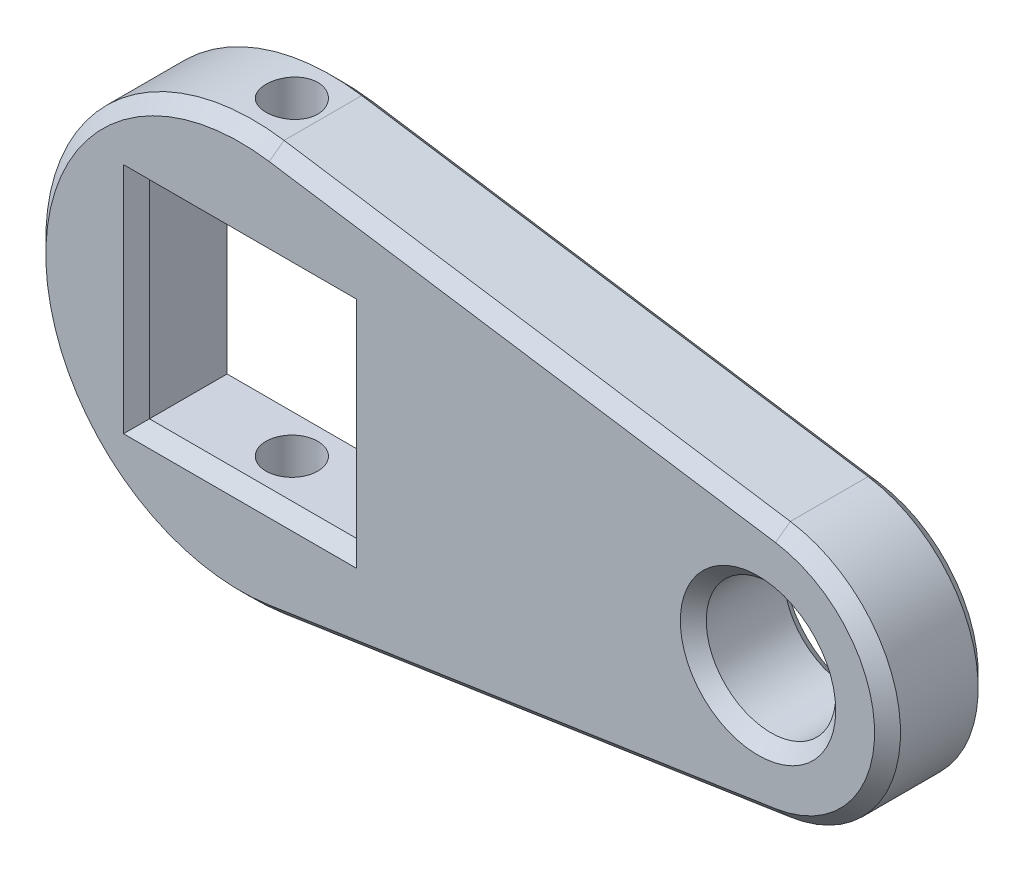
from build123d import *

# Parameters (mm, degrees)
SKETCH_1_R          = 2.5
SKETCH_1_W          = 8
SKETCH_1_H          = 8
EXTRUDE_1_DEPTH     = 2
SKETCH_2_R          = 1
CUT_EXTRUDE_1_DEPTH = 22
CHAMFER_1_SIZE      = 0.5


with BuildPart() as part:
    # Sketch 1 → Extrude 1 (new, symmetric)
    with BuildSketch(Plane.XY):
        with BuildLine():
            Line((1.2, 7.909487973), (20.75, 4.943429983))
            ThreePointArc((20.75, 4.943429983), (25, 0), (20.75, -4.943429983))
            Line((20.75, -4.943429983), (1.2, -7.909487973))
            ThreePointArc((1.2, -7.909487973), (-8, 0), (1.2, 7.909487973))
        make_face()
        with Locations((20, 0)):
            Circle(SKETCH_1_R, mode=Mode.SUBTRACT)
        Rectangle(SKETCH_1_W, SKETCH_1_H, mode=Mode.SUBTRACT)
    extrude(amount=EXTRUDE_1_DEPTH, both=True)

    # Sketch 2 → Cut-Extrude 1 (cut, symmetric)
    with BuildSketch(Plane(origin=(0, 0, 0), x_dir=(1, 0, 0), z_dir=(0, 1, 0))):
        with Locations(Location((0, 0, 0), (0, 0, 270))):
            Circle(SKETCH_2_R)
    extrude(amount=CUT_EXTRUDE_1_DEPTH, both=True, mode=Mode.SUBTRACT)

    # Chamfer 1
    chamfer_1_edges = [part.edges().sort_by_distance(p)[0] for p in [
        (-8, 0, 2),
        (10.975, -6.426458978, 2),
        (-4, 0, -2),
        (0, -4, -2),
        (4, 0, -2),
        (0, 4, -2),
        (-4, 0, 2),
        (0, -4, 2),
        (4, 0, 2),
        (0, 4, 2),
        (17.5, 0, -2),
        (17.5, 0, 2),
        (25, 0, 2),
        (10.975, -6.426458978, -2),
        (-8, 0, -2),
        (10.975, 6.426458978, -2),
        (25, 0, -2),
        (10.975, 6.426458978, 2),
    ]]
    chamfer(chamfer_1_edges, length=CHAMFER_1_SIZE)


solid = part.part
